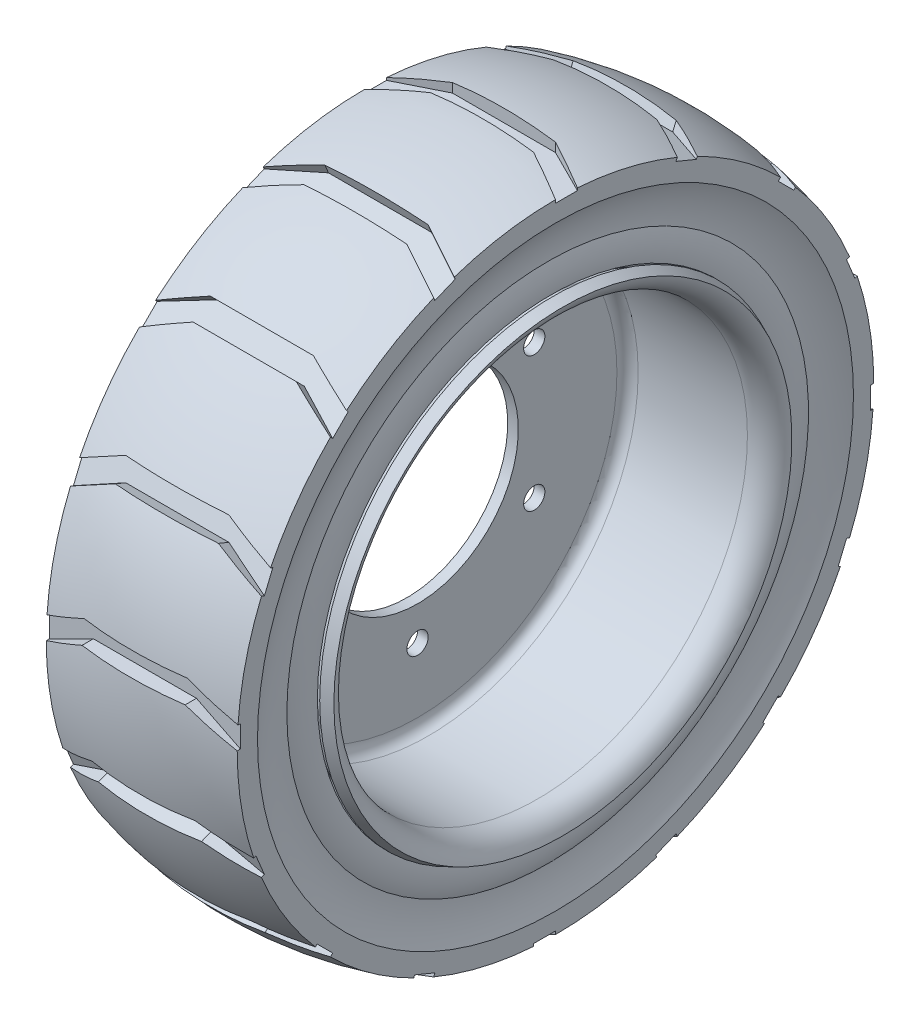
from build123d import *

# Parameters (mm, degrees)
SKETCH5_R           = 10
CUT_EXTRUDE1_DEPTH  = 462.696456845
CIRPATTERN1_COUNT   = 6
CUT_EXTRUDE16_DEPTH = 18
CIRPATTERN2_COUNT   = 16


with BuildPart() as part:
    # Sketch1 → Revolve1 (revolve)
    with BuildSketch(Plane.XY, mode=Mode.PRIVATE) as revolve1_sk:
        with BuildLine():
            ThreePointArc((177.698426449, 219.94763001), (172.489717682, 211.323737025), (163, 207.940331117))
            Line((163, 207.940331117), (17, 207.940331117))
            ThreePointArc((17, 207.940331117), (7.510282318, 211.323737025), (2.301573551, 219.94763001))
            Line((2.301573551, 219.94763001), (-6.979609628, 215.870796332))
            ThreePointArc((-6.979609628, 215.870796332), (2.029000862, 202.918613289), (17, 197.940331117))
            Line((17, 197.940331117), (30, 197.940331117))
            ThreePointArc((30, 197.940331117), (37.071067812, 195.011398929), (40, 187.940331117))
            Line((40, 187.940331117), (40, 95))
            Line((40, 95), (50, 95))
            Line((50, 95), (50, 187.940331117))
            ThreePointArc((50, 187.940331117), (52.928932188, 195.011398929), (60, 197.940331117))
            Line((60, 197.940331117), (163, 197.940331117))
            ThreePointArc((163, 197.940331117), (177.970999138, 202.918613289), (186.979609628, 215.870796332))
            Line((186.979609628, 215.870796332), (177.698426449, 219.94763001))
        make_face()
        with BuildLine():
            Line((180, 280.881746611), (180, 300))
            ThreePointArc((180, 300), (90, 311.769309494), (0, 300))
            Line((0, 300), (0, 280.881746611))
            add(Edge.make_bspline(
                [(0, 280.881746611), (7.971428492, 264.447668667), (7.353378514, 245.850712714)],
                knots=[0, 0, 0, 1, 1, 1], degree=2))
            add(Edge.make_bspline(
                [(7.353378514, 245.850712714), (2.380363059, 233.402495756), (4.420797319, 220)],
                knots=[0, 0, 0, 1, 1, 1], degree=2))
            Line((4.420797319, 220), (16.621958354, 220))
            Line((16.621958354, 220), (19.882275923, 212.044317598))
            ThreePointArc((19.882275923, 212.044317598), (21.723172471, 209.788219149), (24.508844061, 208.940331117))
            Line((24.508844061, 208.940331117), (157.503870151, 208.940331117))
            ThreePointArc((157.503870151, 208.940331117), (158.618138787, 209.27948633), (159.354497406, 210.18192571))
            Line((159.354497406, 210.18192571), (163.378041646, 220))
            Line((163.378041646, 220), (175.579202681, 220))
            add(Edge.make_bspline(
                [(172.646621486, 245.850712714), (177.619636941, 233.402495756), (175.579202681, 220)],
                knots=[0, 0, 0, 1, 1, 1], degree=2))
            add(Edge.make_bspline(
                [(180, 280.881746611), (172.028571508, 264.447668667), (172.646621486, 245.850712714)],
                knots=[0, 0, 0, 1, 1, 1], degree=2))
        make_face()
    revolve(revolve1_sk.sketch.rotate(Axis((0, 0, 0), (1, 0, 0)), 90), axis=Axis((0, 0, 0), (1, 0, 0)))

    # Sketch5 → Cut-Extrude1 (cut, through all)
    with BuildSketch(Plane(origin=(50, 0, 0), x_dir=(0, 0, -1), z_dir=(1, 0, 0))):
        with Locations((0, 127)):
            Circle(SKETCH5_R)
    cut_extrude1 = extrude(amount=-CUT_EXTRUDE1_DEPTH, mode=Mode.SUBTRACT)

    # CirPattern1: Cut-Extrude1 ×6 about axis
    cirpattern1_axis = Axis((0, 0, 0), (1, 0, 0))
    for i in range(1, CIRPATTERN1_COUNT):
        add(cut_extrude1.rotate(cirpattern1_axis, i * 360 / CIRPATTERN1_COUNT), mode=Mode.SUBTRACT)

    # Sketch8 → Cut-Extrude16 (cut)
    with BuildSketch(Plane.XY.offset(315)):
        Polygon((41.417544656, 41.417544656), (0, 20.708772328), (0, 0), (41.417544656, 20.708772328), (138.582455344, 20.708772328), (180, 0), (180, 20.708772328), (138.582455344, 41.417544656), align=None)
    cut_extrude16 = extrude(amount=-CUT_EXTRUDE16_DEPTH, mode=Mode.SUBTRACT)

    # CirPattern2: Cut-Extrude16 ×16 about axis
    cirpattern2_axis = Axis((0, 0, 0), (1, 0, 0))
    for i in range(1, CIRPATTERN2_COUNT):
        add(cut_extrude16.rotate(cirpattern2_axis, i * 360 / CIRPATTERN2_COUNT), mode=Mode.SUBTRACT)


solid = part.part
